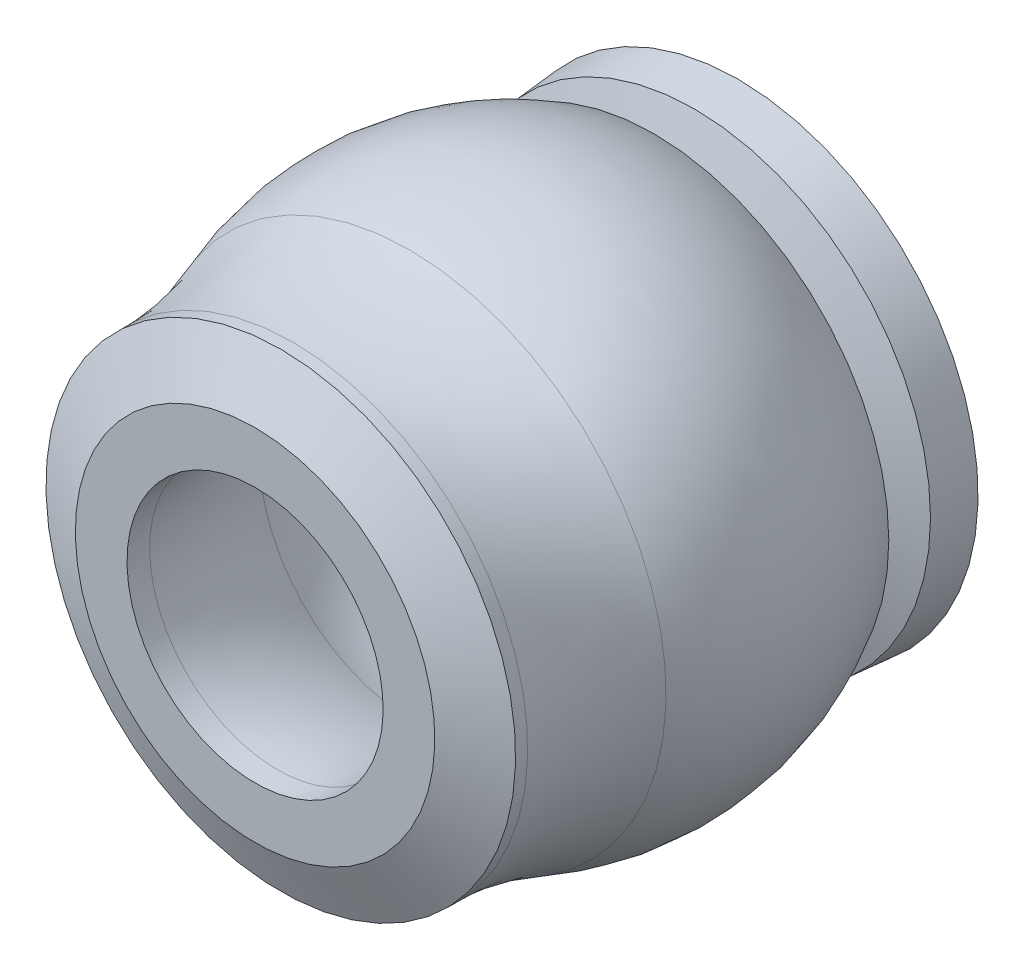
ISO-10303-21;
HEADER;
FILE_DESCRIPTION(('STEP AP214'),'2;1');
FILE_NAME('part.step','',(''),(''),'','','');
FILE_SCHEMA(('AUTOMOTIVE_DESIGN { 1 0 10303 214 1 1 1 1 }'));
ENDSEC;
DATA;
#1=APPLICATION_CONTEXT('core data for automotive mechanical design processes');
#2=APPLICATION_PROTOCOL_DEFINITION('international standard','automotive_design',2000,#1);
#3=PRODUCT_CONTEXT('',#1,'mechanical');
#4=PRODUCT('Part','Part','',(#3));
#5=PRODUCT_RELATED_PRODUCT_CATEGORY('part','',(#4));
#6=PRODUCT_DEFINITION_FORMATION('','',#4);
#7=PRODUCT_DEFINITION_CONTEXT('part definition',#1,'design');
#8=PRODUCT_DEFINITION('design','',#6,#7);
#9=PRODUCT_DEFINITION_SHAPE('','',#8);
#10=(LENGTH_UNIT() NAMED_UNIT(*) SI_UNIT(.MILLI.,.METRE.));
#11=(NAMED_UNIT(*) PLANE_ANGLE_UNIT() SI_UNIT($,.RADIAN.));
#12=(NAMED_UNIT(*) SI_UNIT($,.STERADIAN.) SOLID_ANGLE_UNIT());
#13=UNCERTAINTY_MEASURE_WITH_UNIT(LENGTH_MEASURE(1.E-05),#10,'distance_accuracy_value','');
#14=(GEOMETRIC_REPRESENTATION_CONTEXT(3) GLOBAL_UNCERTAINTY_ASSIGNED_CONTEXT((#13)) GLOBAL_UNIT_ASSIGNED_CONTEXT((#10,
#11,#12)) REPRESENTATION_CONTEXT('',''));
#15=CARTESIAN_POINT('',(0.,0.,0.));
#16=DIRECTION('',(0.,0.,1.));
#17=DIRECTION('',(1.,0.,0.));
#18=AXIS2_PLACEMENT_3D('',#15,#16,#17);
#19=CARTESIAN_POINT('',(0.,-4.61373238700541,19.009484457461));
#20=DIRECTION('',(1.,0.,0.));
#21=DIRECTION('',(0.,1.,0.));
#22=AXIS2_PLACEMENT_3D('',#19,#20,#21);
#23=CIRCLE('',#22,17.8487334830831);
#24=TRIMMED_CURVE('',#23,(PARAMETER_VALUE(-1.30933680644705)),
(PARAMETER_VALUE(1.30933680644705)),.T.,.PARAMETER.);
#25=CARTESIAN_POINT('',(0.,0.,19.009484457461));
#26=DIRECTION('',(0.,0.,-1.));
#27=AXIS1_PLACEMENT('',#25,#26);
#28=SURFACE_OF_REVOLUTION('',#24,#27);
#29=CARTESIAN_POINT('',(0.,0.,8.80896891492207));
#30=DIRECTION('',(0.,0.,1.));
#31=DIRECTION('',(0.,-1.,0.));
#32=AXIS2_PLACEMENT_3D('',#29,#30,#31);
#33=CIRCLE('',#32,10.033);
#34=CARTESIAN_POINT('',(0.,-10.033,8.80896891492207));
#35=VERTEX_POINT('',#34);
#36=EDGE_CURVE('E88',#35,#35,#33,.F.);
#37=ORIENTED_EDGE('',*,*,#36,.T.);
#38=EDGE_LOOP('',(#37));
#39=FACE_BOUND('',#38,.T.);
#40=CARTESIAN_POINT('',(0.,0.,25.4808628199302));
#41=DIRECTION('',(0.,0.,-1.));
#42=DIRECTION('',(0.,1.,0.));
#43=AXIS2_PLACEMENT_3D('',#40,#41,#42);
#44=CIRCLE('',#43,12.0205259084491);
#45=CARTESIAN_POINT('',(0.,12.0205259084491,25.4808628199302));
#46=VERTEX_POINT('',#45);
#47=EDGE_CURVE('E90',#46,#46,#44,.T.);
#48=ORIENTED_EDGE('',*,*,#47,.F.);
#49=EDGE_LOOP('',(#48));
#50=FACE_BOUND('',#49,.T.);
#51=ADVANCED_FACE('F12',(#39,#50),#28,.T.);
#52=CARTESIAN_POINT('',(0.,0.,36.0714720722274));
#53=DIRECTION('',(0.,0.,-1.));
#54=DIRECTION('',(0.,1.,0.));
#55=AXIS2_PLACEMENT_3D('',#52,#53,#54);
#56=TOROIDAL_SURFACE('',#55,39.243,29.21);
#57=ORIENTED_EDGE('',*,*,#47,.T.);
#58=EDGE_LOOP('',(#57));
#59=FACE_BOUND('',#58,.T.);
#60=CARTESIAN_POINT('',(0.,0.,36.0714720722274));
#61=DIRECTION('',(0.,0.,-1.));
#62=DIRECTION('',(0.,1.,0.));
#63=AXIS2_PLACEMENT_3D('',#60,#61,#62);
#64=CIRCLE('',#63,10.033);
#65=CARTESIAN_POINT('',(0.,10.033,36.0714720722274));
#66=VERTEX_POINT('',#65);
#67=EDGE_CURVE('E86',#66,#66,#64,.F.);
#68=ORIENTED_EDGE('',*,*,#67,.T.);
#69=EDGE_LOOP('',(#68));
#70=FACE_BOUND('',#69,.T.);
#71=ADVANCED_FACE('F78',(#59,#70),#56,.T.);
#72=CARTESIAN_POINT('',(0.,0.,8.80896891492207));
#73=DIRECTION('',(0.,0.,1.));
#74=DIRECTION('',(0.,-1.,0.));
#75=AXIS2_PLACEMENT_3D('',#72,#73,#74);
#76=CONICAL_SURFACE('',#75,10.033,1.0471975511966);
#77=ORIENTED_EDGE('',*,*,#36,.F.);
#78=EDGE_LOOP('',(#77));
#79=FACE_BOUND('',#78,.T.);
#80=CARTESIAN_POINT('',(0.,0.,6.096));
#81=DIRECTION('',(0.,0.,-1.));
#82=DIRECTION('',(0.,1.,0.));
#83=AXIS2_PLACEMENT_3D('',#80,#81,#82);
#84=CIRCLE('',#83,5.334);
#85=CARTESIAN_POINT('',(0.,5.334,6.096));
#86=VERTEX_POINT('',#85);
#87=EDGE_CURVE('E105',#86,#86,#84,.T.);
#88=ORIENTED_EDGE('',*,*,#87,.T.);
#89=EDGE_LOOP('',(#88));
#90=FACE_BOUND('',#89,.T.);
#91=ADVANCED_FACE('F75',(#79,#90),#76,.F.);
#92=CARTESIAN_POINT('',(0.,0.,-15.4763663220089));
#93=DIRECTION('',(0.,0.,-1.));
#94=DIRECTION('',(0.,1.,0.));
#95=AXIS2_PLACEMENT_3D('',#92,#93,#94);
#96=CYLINDRICAL_SURFACE('',#95,10.033);
#97=ORIENTED_EDGE('',*,*,#67,.F.);
#98=EDGE_LOOP('',(#97));
#99=FACE_BOUND('',#98,.T.);
#100=CARTESIAN_POINT('',(0.,0.,37.846));
#101=DIRECTION('',(0.,0.,-1.));
#102=DIRECTION('',(0.,1.,0.));
#103=AXIS2_PLACEMENT_3D('',#100,#101,#102);
#104=CIRCLE('',#103,10.033);
#105=CARTESIAN_POINT('',(0.,10.033,37.846));
#106=VERTEX_POINT('',#105);
#107=EDGE_CURVE('E16',#106,#106,#104,.T.);
#108=ORIENTED_EDGE('',*,*,#107,.F.);
#109=EDGE_LOOP('',(#108));
#110=FACE_BOUND('',#109,.T.);
#111=ADVANCED_FACE('F71',(#99,#110),#96,.F.);
#112=CARTESIAN_POINT('',(0.,0.,-15.4763663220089));
#113=DIRECTION('',(0.,0.,-1.));
#114=DIRECTION('',(0.,1.,0.));
#115=AXIS2_PLACEMENT_3D('',#112,#113,#114);
#116=CYLINDRICAL_SURFACE('',#115,5.334);
#117=CARTESIAN_POINT('',(0.,0.,0.));
#118=DIRECTION('',(0.,0.,-1.));
#119=DIRECTION('',(0.,1.,0.));
#120=AXIS2_PLACEMENT_3D('',#117,#118,#119);
#121=CIRCLE('',#120,5.334);
#122=CARTESIAN_POINT('',(0.,5.334,0.));
#123=VERTEX_POINT('',#122);
#124=EDGE_CURVE('E101',#123,#123,#121,.F.);
#125=ORIENTED_EDGE('',*,*,#124,.F.);
#126=EDGE_LOOP('',(#125));
#127=FACE_BOUND('',#126,.T.);
#128=ORIENTED_EDGE('',*,*,#87,.F.);
#129=EDGE_LOOP('',(#128));
#130=FACE_BOUND('',#129,.T.);
#131=ADVANCED_FACE('F67',(#127,#130),#116,.F.);
#132=CARTESIAN_POINT('',(14.0823361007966,0.,37.846));
#133=DIRECTION('',(0.,0.,1.));
#134=DIRECTION('',(0.,-1.,0.));
#135=AXIS2_PLACEMENT_3D('',#132,#133,#134);
#136=PLANE('',#135);
#137=CARTESIAN_POINT('',(0.,0.,37.846));
#138=DIRECTION('',(0.,0.,-1.));
#139=DIRECTION('',(0.,1.,0.));
#140=AXIS2_PLACEMENT_3D('',#137,#138,#139);
#141=CIRCLE('',#140,14.0823361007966);
#142=CARTESIAN_POINT('',(0.,14.0823361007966,37.846));
#143=VERTEX_POINT('',#142);
#144=EDGE_CURVE('E99',#143,#143,#141,.T.);
#145=ORIENTED_EDGE('',*,*,#144,.F.);
#146=EDGE_LOOP('',(#145));
#147=FACE_BOUND('',#146,.T.);
#148=ORIENTED_EDGE('',*,*,#107,.T.);
#149=EDGE_LOOP('',(#148));
#150=FACE_BOUND('',#149,.T.);
#151=ADVANCED_FACE('F63',(#147,#150),#136,.T.);
#152=CARTESIAN_POINT('',(5.334,0.,0.));
#153=DIRECTION('',(0.,0.,-1.));
#154=DIRECTION('',(0.,1.,0.));
#155=AXIS2_PLACEMENT_3D('',#152,#153,#154);
#156=PLANE('',#155);
#157=ORIENTED_EDGE('',*,*,#124,.T.);
#158=EDGE_LOOP('',(#157));
#159=FACE_BOUND('',#158,.T.);
#160=CARTESIAN_POINT('',(0.,0.,0.));
#161=DIRECTION('',(0.,0.,-1.));
#162=DIRECTION('',(0.,1.,0.));
#163=AXIS2_PLACEMENT_3D('',#160,#161,#162);
#164=CIRCLE('',#163,18.796);
#165=CARTESIAN_POINT('',(0.,18.796,0.));
#166=VERTEX_POINT('',#165);
#167=EDGE_CURVE('E95',#166,#166,#164,.F.);
#168=ORIENTED_EDGE('',*,*,#167,.F.);
#169=EDGE_LOOP('',(#168));
#170=FACE_BOUND('',#169,.T.);
#171=ADVANCED_FACE('F59',(#159,#170),#156,.T.);
#172=CARTESIAN_POINT('',(0.,0.,35.8324835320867));
#173=DIRECTION('',(0.,0.,-1.));
#174=DIRECTION('',(0.,1.,0.));
#175=AXIS2_PLACEMENT_3D('',#172,#173,#174);
#176=CONICAL_SURFACE('',#175,18.4003361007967,1.13446401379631);
#177=ORIENTED_EDGE('',*,*,#144,.T.);
#178=EDGE_LOOP('',(#177));
#179=FACE_BOUND('',#178,.T.);
#180=CARTESIAN_POINT('',(0.,0.,35.8324835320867));
#181=DIRECTION('',(0.,0.,-1.));
#182=DIRECTION('',(0.,1.,0.));
#183=AXIS2_PLACEMENT_3D('',#180,#181,#182);
#184=CIRCLE('',#183,18.4003361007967);
#185=CARTESIAN_POINT('',(0.,18.4003361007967,35.8324835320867));
#186=VERTEX_POINT('',#185);
#187=EDGE_CURVE('E98',#186,#186,#184,.T.);
#188=ORIENTED_EDGE('',*,*,#187,.F.);
#189=EDGE_LOOP('',(#188));
#190=FACE_BOUND('',#189,.T.);
#191=ADVANCED_FACE('F55',(#179,#190),#176,.T.);
#192=CARTESIAN_POINT('',(0.,0.,0.));
#193=DIRECTION('',(0.,0.,-1.));
#194=DIRECTION('',(0.,1.,0.));
#195=AXIS2_PLACEMENT_3D('',#192,#193,#194);
#196=CONICAL_SURFACE('',#195,18.796,0.0872664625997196);
#197=CARTESIAN_POINT('',(0.,0.,3.429));
#198=DIRECTION('',(0.,0.,-1.));
#199=DIRECTION('',(0.,1.,0.));
#200=AXIS2_PLACEMENT_3D('',#197,#198,#199);
#201=CIRCLE('',#200,18.4960013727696);
#202=CARTESIAN_POINT('',(0.,18.4960013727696,3.429));
#203=VERTEX_POINT('',#202);
#204=EDGE_CURVE('E114',#203,#203,#201,.F.);
#205=ORIENTED_EDGE('',*,*,#204,.F.);
#206=EDGE_LOOP('',(#205));
#207=FACE_BOUND('',#206,.T.);
#208=ORIENTED_EDGE('',*,*,#167,.T.);
#209=EDGE_LOOP('',(#208));
#210=FACE_BOUND('',#209,.T.);
#211=ADVANCED_FACE('F51',(#207,#210),#196,.T.);
#212=CARTESIAN_POINT('',(0.,0.,-15.4763663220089));
#213=DIRECTION('',(0.,0.,-1.));
#214=DIRECTION('',(0.,1.,0.));
#215=AXIS2_PLACEMENT_3D('',#212,#213,#214);
#216=CYLINDRICAL_SURFACE('',#215,18.4003361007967);
#217=ORIENTED_EDGE('',*,*,#187,.T.);
#218=EDGE_LOOP('',(#217));
#219=FACE_BOUND('',#218,.T.);
#220=CARTESIAN_POINT('',(0.,0.,34.8844353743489));
#221=DIRECTION('',(0.,0.,-1.));
#222=DIRECTION('',(0.,1.,0.));
#223=AXIS2_PLACEMENT_3D('',#220,#221,#222);
#224=CIRCLE('',#223,18.4003361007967);
#225=CARTESIAN_POINT('',(0.,18.4003361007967,34.8844353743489));
#226=VERTEX_POINT('',#225);
#227=EDGE_CURVE('E32',#226,#226,#224,.F.);
#228=ORIENTED_EDGE('',*,*,#227,.T.);
#229=EDGE_LOOP('',(#228));
#230=FACE_BOUND('',#229,.T.);
#231=ADVANCED_FACE('F47',(#219,#230),#216,.T.);
#232=CARTESIAN_POINT('',(0.,0.,3.429));
#233=DIRECTION('',(0.,0.,-1.));
#234=DIRECTION('',(1.,0.,0.));
#235=AXIS2_PLACEMENT_3D('',#232,#233,#234);
#236=CONICAL_SURFACE('',#235,18.4960013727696,1.27236012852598);
#237=CARTESIAN_POINT('',(0.,0.,4.75731886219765));
#238=DIRECTION('',(0.,0.,1.));
#239=DIRECTION('',(0.,-1.,0.));
#240=AXIS2_PLACEMENT_3D('',#237,#238,#239);
#241=CIRCLE('',#240,14.1780013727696);
#242=CARTESIAN_POINT('',(0.,-14.1780013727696,4.75731886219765));
#243=VERTEX_POINT('',#242);
#244=EDGE_CURVE('E25',#243,#243,#241,.T.);
#245=ORIENTED_EDGE('',*,*,#244,.F.);
#246=EDGE_LOOP('',(#245));
#247=FACE_BOUND('',#246,.T.);
#248=ORIENTED_EDGE('',*,*,#204,.T.);
#249=EDGE_LOOP('',(#248));
#250=FACE_BOUND('',#249,.T.);
#251=ADVANCED_FACE('F42',(#247,#250),#236,.T.);
#252=CARTESIAN_POINT('',(0.,0.,34.8844353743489));
#253=DIRECTION('',(0.,0.,-1.));
#254=DIRECTION('',(0.,1.,0.));
#255=AXIS2_PLACEMENT_3D('',#252,#253,#254);
#256=TOROIDAL_SURFACE('',#255,43.8003361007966,25.4);
#257=ORIENTED_EDGE('',*,*,#227,.F.);
#258=EDGE_LOOP('',(#257));
#259=FACE_BOUND('',#258,.T.);
#260=CARTESIAN_POINT('',(0.,0.,25.7482102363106));
#261=DIRECTION('',(0.,0.,-1.));
#262=DIRECTION('',(0.,1.,0.));
#263=AXIS2_PLACEMENT_3D('',#260,#261,#262);
#264=CIRCLE('',#263,20.1003489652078);
#265=CARTESIAN_POINT('',(0.,20.1003489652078,25.7482102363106));
#266=VERTEX_POINT('',#265);
#267=EDGE_CURVE('E20',#266,#266,#264,.T.);
#268=ORIENTED_EDGE('',*,*,#267,.F.);
#269=EDGE_LOOP('',(#268));
#270=FACE_BOUND('',#269,.T.);
#271=ADVANCED_FACE('F37',(#259,#270),#256,.F.);
#272=CARTESIAN_POINT('',(0.,0.,6.59914113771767));
#273=DIRECTION('',(0.,0.,1.));
#274=DIRECTION('',(0.,-1.,0.));
#275=AXIS2_PLACEMENT_3D('',#272,#273,#274);
#276=CONICAL_SURFACE('',#275,18.4003361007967,1.1594696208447);
#277=ORIENTED_EDGE('',*,*,#244,.T.);
#278=EDGE_LOOP('',(#277));
#279=FACE_BOUND('',#278,.T.);
#280=CARTESIAN_POINT('',(0.,0.,6.59914113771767));
#281=DIRECTION('',(0.,0.,-1.));
#282=DIRECTION('',(0.,1.,0.));
#283=AXIS2_PLACEMENT_3D('',#280,#281,#282);
#284=CIRCLE('',#283,18.4003361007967);
#285=CARTESIAN_POINT('',(0.,18.4003361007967,6.59914113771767));
#286=VERTEX_POINT('',#285);
#287=EDGE_CURVE('E8',#286,#286,#284,.F.);
#288=ORIENTED_EDGE('',*,*,#287,.F.);
#289=EDGE_LOOP('',(#288));
#290=FACE_BOUND('',#289,.T.);
#291=ADVANCED_FACE('F41',(#279,#290),#276,.T.);
#292=CARTESIAN_POINT('',(0.,-0.24658386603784,17.9045705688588));
#293=DIRECTION('',(1.,0.,0.));
#294=DIRECTION('',(0.,1.,0.));
#295=AXIS2_PLACEMENT_3D('',#292,#293,#294);
#296=CIRCLE('',#295,21.8064293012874);
#297=TRIMMED_CURVE('',#296,(PARAMETER_VALUE(-1.55948823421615)),
(PARAMETER_VALUE(1.55948823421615)),.T.,.PARAMETER.);
#298=CARTESIAN_POINT('',(0.,0.,17.9045705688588));
#299=DIRECTION('',(0.,0.,-1.));
#300=AXIS1_PLACEMENT('',#298,#299);
#301=SURFACE_OF_REVOLUTION('',#297,#300);
#302=ORIENTED_EDGE('',*,*,#267,.T.);
#303=EDGE_LOOP('',(#302));
#304=FACE_BOUND('',#303,.T.);
#305=ORIENTED_EDGE('',*,*,#287,.T.);
#306=EDGE_LOOP('',(#305));
#307=FACE_BOUND('',#306,.T.);
#308=ADVANCED_FACE('F124',(#304,#307),#301,.F.);
#309=CLOSED_SHELL('',(#51,#71,#91,#111,#131,#151,#171,#191,#211,#231,#251,#271,#291,#308));
#310=MANIFOLD_SOLID_BREP('B1',#309);
#311=ADVANCED_BREP_SHAPE_REPRESENTATION('',(#18,#310),#14);
#312=SHAPE_DEFINITION_REPRESENTATION(#9,#311);
ENDSEC;
END-ISO-10303-21;
